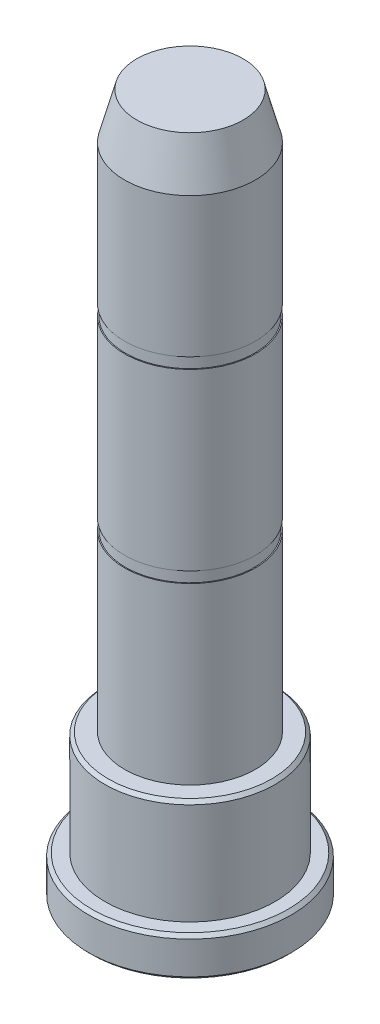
ISO-10303-21;
HEADER;
FILE_DESCRIPTION(('STEP AP214'),'2;1');
FILE_NAME('part.step','',(''),(''),'','','');
FILE_SCHEMA(('AUTOMOTIVE_DESIGN { 1 0 10303 214 1 1 1 1 }'));
ENDSEC;
DATA;
#1=APPLICATION_CONTEXT('core data for automotive mechanical design processes');
#2=APPLICATION_PROTOCOL_DEFINITION('international standard','automotive_design',2000,#1);
#3=PRODUCT_CONTEXT('',#1,'mechanical');
#4=PRODUCT('Part','Part','',(#3));
#5=PRODUCT_RELATED_PRODUCT_CATEGORY('part','',(#4));
#6=PRODUCT_DEFINITION_FORMATION('','',#4);
#7=PRODUCT_DEFINITION_CONTEXT('part definition',#1,'design');
#8=PRODUCT_DEFINITION('design','',#6,#7);
#9=PRODUCT_DEFINITION_SHAPE('','',#8);
#10=(LENGTH_UNIT() NAMED_UNIT(*) SI_UNIT(.MILLI.,.METRE.));
#11=(NAMED_UNIT(*) PLANE_ANGLE_UNIT() SI_UNIT($,.RADIAN.));
#12=(NAMED_UNIT(*) SI_UNIT($,.STERADIAN.) SOLID_ANGLE_UNIT());
#13=UNCERTAINTY_MEASURE_WITH_UNIT(LENGTH_MEASURE(1.E-05),#10,'distance_accuracy_value','');
#14=(GEOMETRIC_REPRESENTATION_CONTEXT(3) GLOBAL_UNCERTAINTY_ASSIGNED_CONTEXT((#13)) GLOBAL_UNIT_ASSIGNED_CONTEXT((#10,
#11,#12)) REPRESENTATION_CONTEXT('',''));
#15=CARTESIAN_POINT('',(0.,0.,0.));
#16=DIRECTION('',(0.,0.,1.));
#17=DIRECTION('',(1.,0.,0.));
#18=AXIS2_PLACEMENT_3D('',#15,#16,#17);
#19=CARTESIAN_POINT('',(-8.12435565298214,101.,0.));
#20=DIRECTION('',(0.,-1.,0.));
#21=DIRECTION('',(1.,0.,0.));
#22=AXIS2_PLACEMENT_3D('',#19,#20,#21);
#23=PLANE('',#22);
#24=CARTESIAN_POINT('',(0.,101.,0.));
#25=DIRECTION('',(0.,1.,0.));
#26=DIRECTION('',(-1.,0.,0.));
#27=AXIS2_PLACEMENT_3D('',#24,#25,#26);
#28=CIRCLE('',#27,8.12435565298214);
#29=CARTESIAN_POINT('',(-8.12435565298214,101.,0.));
#30=VERTEX_POINT('',#29);
#31=EDGE_CURVE('E49',#30,#30,#28,.T.);
#32=ORIENTED_EDGE('',*,*,#31,.T.);
#33=EDGE_LOOP('',(#32));
#34=FACE_BOUND('',#33,.T.);
#35=ADVANCED_FACE('F13',(#34),#23,.F.);
#36=CARTESIAN_POINT('',(0.,101.,0.));
#37=DIRECTION('',(0.,-1.,0.));
#38=DIRECTION('',(1.,0.,0.));
#39=AXIS2_PLACEMENT_3D('',#36,#37,#38);
#40=CONICAL_SURFACE('',#39,8.12435565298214,0.261799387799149);
#41=CARTESIAN_POINT('',(0.,94.,0.));
#42=DIRECTION('',(0.,1.,0.));
#43=DIRECTION('',(-1.,0.,0.));
#44=AXIS2_PLACEMENT_3D('',#41,#42,#43);
#45=CIRCLE('',#44,10.);
#46=CARTESIAN_POINT('',(-10.,94.,0.));
#47=VERTEX_POINT('',#46);
#48=EDGE_CURVE('E52',#47,#47,#45,.T.);
#49=ORIENTED_EDGE('',*,*,#48,.T.);
#50=EDGE_LOOP('',(#49));
#51=FACE_BOUND('',#50,.T.);
#52=ORIENTED_EDGE('',*,*,#31,.F.);
#53=EDGE_LOOP('',(#52));
#54=FACE_BOUND('',#53,.T.);
#55=ADVANCED_FACE('F112',(#51,#54),#40,.T.);
#56=CARTESIAN_POINT('',(0.,101.,0.));
#57=DIRECTION('',(0.,1.,0.));
#58=DIRECTION('',(-1.,0.,0.));
#59=AXIS2_PLACEMENT_3D('',#56,#57,#58);
#60=CYLINDRICAL_SURFACE('',#59,10.);
#61=ORIENTED_EDGE('',*,*,#48,.F.);
#62=EDGE_LOOP('',(#61));
#63=FACE_BOUND('',#62,.T.);
#64=CARTESIAN_POINT('',(0.,72.6666666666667,0.));
#65=DIRECTION('',(0.,1.,0.));
#66=DIRECTION('',(-1.,0.,0.));
#67=AXIS2_PLACEMENT_3D('',#64,#65,#66);
#68=CIRCLE('',#67,10.);
#69=CARTESIAN_POINT('',(-10.,72.6666666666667,0.));
#70=VERTEX_POINT('',#69);
#71=EDGE_CURVE('E56',#70,#70,#68,.T.);
#72=ORIENTED_EDGE('',*,*,#71,.T.);
#73=EDGE_LOOP('',(#72));
#74=FACE_BOUND('',#73,.T.);
#75=ADVANCED_FACE('F117',(#63,#74),#60,.T.);
#76=CARTESIAN_POINT('',(-9.85,72.6666666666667,0.));
#77=DIRECTION('',(0.,1.,0.));
#78=DIRECTION('',(-1.,0.,0.));
#79=AXIS2_PLACEMENT_3D('',#76,#77,#78);
#80=PLANE('',#79);
#81=ORIENTED_EDGE('',*,*,#71,.F.);
#82=EDGE_LOOP('',(#81));
#83=FACE_BOUND('',#82,.T.);
#84=CARTESIAN_POINT('',(0.,72.6666666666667,0.));
#85=DIRECTION('',(0.,1.,0.));
#86=DIRECTION('',(-1.,0.,0.));
#87=AXIS2_PLACEMENT_3D('',#84,#85,#86);
#88=CIRCLE('',#87,9.85);
#89=CARTESIAN_POINT('',(-9.85,72.6666666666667,0.));
#90=VERTEX_POINT('',#89);
#91=EDGE_CURVE('E60',#90,#90,#88,.T.);
#92=ORIENTED_EDGE('',*,*,#91,.T.);
#93=EDGE_LOOP('',(#92));
#94=FACE_BOUND('',#93,.T.);
#95=ADVANCED_FACE('F262',(#83,#94),#80,.F.);
#96=CARTESIAN_POINT('',(0.,101.,0.));
#97=DIRECTION('',(0.,1.,0.));
#98=DIRECTION('',(-1.,0.,0.));
#99=AXIS2_PLACEMENT_3D('',#96,#97,#98);
#100=CYLINDRICAL_SURFACE('',#99,9.85);
#101=ORIENTED_EDGE('',*,*,#91,.F.);
#102=EDGE_LOOP('',(#101));
#103=FACE_BOUND('',#102,.T.);
#104=CARTESIAN_POINT('',(0.,71.,0.));
#105=DIRECTION('',(0.,1.,0.));
#106=DIRECTION('',(-1.,0.,0.));
#107=AXIS2_PLACEMENT_3D('',#104,#105,#106);
#108=CIRCLE('',#107,9.85);
#109=CARTESIAN_POINT('',(-9.85,71.,0.));
#110=VERTEX_POINT('',#109);
#111=EDGE_CURVE('E64',#110,#110,#108,.T.);
#112=ORIENTED_EDGE('',*,*,#111,.T.);
#113=EDGE_LOOP('',(#112));
#114=FACE_BOUND('',#113,.T.);
#115=ADVANCED_FACE('F252',(#103,#114),#100,.T.);
#116=CARTESIAN_POINT('',(-10.,71.,0.));
#117=DIRECTION('',(0.,-1.,0.));
#118=DIRECTION('',(1.,0.,0.));
#119=AXIS2_PLACEMENT_3D('',#116,#117,#118);
#120=PLANE('',#119);
#121=ORIENTED_EDGE('',*,*,#111,.F.);
#122=EDGE_LOOP('',(#121));
#123=FACE_BOUND('',#122,.T.);
#124=CARTESIAN_POINT('',(0.,71.,0.));
#125=DIRECTION('',(0.,1.,0.));
#126=DIRECTION('',(-1.,0.,0.));
#127=AXIS2_PLACEMENT_3D('',#124,#125,#126);
#128=CIRCLE('',#127,10.);
#129=CARTESIAN_POINT('',(-10.,71.,0.));
#130=VERTEX_POINT('',#129);
#131=EDGE_CURVE('E68',#130,#130,#128,.T.);
#132=ORIENTED_EDGE('',*,*,#131,.T.);
#133=EDGE_LOOP('',(#132));
#134=FACE_BOUND('',#133,.T.);
#135=ADVANCED_FACE('F242',(#123,#134),#120,.F.);
#136=CARTESIAN_POINT('',(0.,101.,0.));
#137=DIRECTION('',(0.,1.,0.));
#138=DIRECTION('',(-1.,0.,0.));
#139=AXIS2_PLACEMENT_3D('',#136,#137,#138);
#140=CYLINDRICAL_SURFACE('',#139,10.);
#141=ORIENTED_EDGE('',*,*,#131,.F.);
#142=EDGE_LOOP('',(#141));
#143=FACE_BOUND('',#142,.T.);
#144=CARTESIAN_POINT('',(0.,44.3333333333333,0.));
#145=DIRECTION('',(0.,1.,0.));
#146=DIRECTION('',(-1.,0.,0.));
#147=AXIS2_PLACEMENT_3D('',#144,#145,#146);
#148=CIRCLE('',#147,10.);
#149=CARTESIAN_POINT('',(-10.,44.3333333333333,0.));
#150=VERTEX_POINT('',#149);
#151=EDGE_CURVE('E72',#150,#150,#148,.T.);
#152=ORIENTED_EDGE('',*,*,#151,.T.);
#153=EDGE_LOOP('',(#152));
#154=FACE_BOUND('',#153,.T.);
#155=ADVANCED_FACE('F232',(#143,#154),#140,.T.);
#156=CARTESIAN_POINT('',(-9.85,44.3333333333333,0.));
#157=DIRECTION('',(0.,1.,0.));
#158=DIRECTION('',(-1.,0.,0.));
#159=AXIS2_PLACEMENT_3D('',#156,#157,#158);
#160=PLANE('',#159);
#161=ORIENTED_EDGE('',*,*,#151,.F.);
#162=EDGE_LOOP('',(#161));
#163=FACE_BOUND('',#162,.T.);
#164=CARTESIAN_POINT('',(0.,44.3333333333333,0.));
#165=DIRECTION('',(0.,1.,0.));
#166=DIRECTION('',(-1.,0.,0.));
#167=AXIS2_PLACEMENT_3D('',#164,#165,#166);
#168=CIRCLE('',#167,9.85);
#169=CARTESIAN_POINT('',(-9.85,44.3333333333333,0.));
#170=VERTEX_POINT('',#169);
#171=EDGE_CURVE('E75',#170,#170,#168,.T.);
#172=ORIENTED_EDGE('',*,*,#171,.T.);
#173=EDGE_LOOP('',(#172));
#174=FACE_BOUND('',#173,.T.);
#175=ADVANCED_FACE('F222',(#163,#174),#160,.F.);
#176=CARTESIAN_POINT('',(0.,101.,0.));
#177=DIRECTION('',(0.,1.,0.));
#178=DIRECTION('',(-1.,0.,0.));
#179=AXIS2_PLACEMENT_3D('',#176,#177,#178);
#180=CYLINDRICAL_SURFACE('',#179,9.85);
#181=ORIENTED_EDGE('',*,*,#171,.F.);
#182=EDGE_LOOP('',(#181));
#183=FACE_BOUND('',#182,.T.);
#184=CARTESIAN_POINT('',(0.,42.6666666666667,0.));
#185=DIRECTION('',(0.,1.,0.));
#186=DIRECTION('',(-1.,0.,0.));
#187=AXIS2_PLACEMENT_3D('',#184,#185,#186);
#188=CIRCLE('',#187,9.85);
#189=CARTESIAN_POINT('',(-9.85,42.6666666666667,0.));
#190=VERTEX_POINT('',#189);
#191=EDGE_CURVE('E79',#190,#190,#188,.T.);
#192=ORIENTED_EDGE('',*,*,#191,.T.);
#193=EDGE_LOOP('',(#192));
#194=FACE_BOUND('',#193,.T.);
#195=ADVANCED_FACE('F212',(#183,#194),#180,.T.);
#196=CARTESIAN_POINT('',(-10.,42.6666666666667,0.));
#197=DIRECTION('',(0.,-1.,0.));
#198=DIRECTION('',(1.,0.,0.));
#199=AXIS2_PLACEMENT_3D('',#196,#197,#198);
#200=PLANE('',#199);
#201=ORIENTED_EDGE('',*,*,#191,.F.);
#202=EDGE_LOOP('',(#201));
#203=FACE_BOUND('',#202,.T.);
#204=CARTESIAN_POINT('',(0.,42.6666666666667,0.));
#205=DIRECTION('',(0.,1.,0.));
#206=DIRECTION('',(-1.,0.,0.));
#207=AXIS2_PLACEMENT_3D('',#204,#205,#206);
#208=CIRCLE('',#207,10.);
#209=CARTESIAN_POINT('',(-10.,42.6666666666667,0.));
#210=VERTEX_POINT('',#209);
#211=EDGE_CURVE('E83',#210,#210,#208,.T.);
#212=ORIENTED_EDGE('',*,*,#211,.T.);
#213=EDGE_LOOP('',(#212));
#214=FACE_BOUND('',#213,.T.);
#215=ADVANCED_FACE('F202',(#203,#214),#200,.F.);
#216=CARTESIAN_POINT('',(0.,101.,0.));
#217=DIRECTION('',(0.,1.,0.));
#218=DIRECTION('',(-1.,0.,0.));
#219=AXIS2_PLACEMENT_3D('',#216,#217,#218);
#220=CYLINDRICAL_SURFACE('',#219,10.);
#221=ORIENTED_EDGE('',*,*,#211,.F.);
#222=EDGE_LOOP('',(#221));
#223=FACE_BOUND('',#222,.T.);
#224=CARTESIAN_POINT('',(0.,16.,0.));
#225=DIRECTION('',(0.,1.,0.));
#226=DIRECTION('',(-1.,0.,0.));
#227=AXIS2_PLACEMENT_3D('',#224,#225,#226);
#228=CIRCLE('',#227,10.);
#229=CARTESIAN_POINT('',(-10.,16.,0.));
#230=VERTEX_POINT('',#229);
#231=EDGE_CURVE('E86',#230,#230,#228,.T.);
#232=ORIENTED_EDGE('',*,*,#231,.T.);
#233=EDGE_LOOP('',(#232));
#234=FACE_BOUND('',#233,.T.);
#235=ADVANCED_FACE('F192',(#223,#234),#220,.T.);
#236=CARTESIAN_POINT('',(-13.,16.,0.));
#237=DIRECTION('',(0.,-1.,0.));
#238=DIRECTION('',(1.,0.,0.));
#239=AXIS2_PLACEMENT_3D('',#236,#237,#238);
#240=PLANE('',#239);
#241=CARTESIAN_POINT('',(0.,16.,0.));
#242=DIRECTION('',(0.,-1.,0.));
#243=DIRECTION('',(1.,0.,0.));
#244=AXIS2_PLACEMENT_3D('',#241,#242,#243);
#245=CIRCLE('',#244,12.5);
#246=CARTESIAN_POINT('',(12.5,16.,0.));
#247=VERTEX_POINT('',#246);
#248=EDGE_CURVE('E46',#247,#247,#245,.F.);
#249=ORIENTED_EDGE('',*,*,#248,.T.);
#250=EDGE_LOOP('',(#249));
#251=FACE_BOUND('',#250,.T.);
#252=ORIENTED_EDGE('',*,*,#231,.F.);
#253=EDGE_LOOP('',(#252));
#254=FACE_BOUND('',#253,.T.);
#255=ADVANCED_FACE('F108',(#251,#254),#240,.F.);
#256=CARTESIAN_POINT('',(0.,101.,0.));
#257=DIRECTION('',(0.,1.,0.));
#258=DIRECTION('',(-1.,0.,0.));
#259=AXIS2_PLACEMENT_3D('',#256,#257,#258);
#260=CYLINDRICAL_SURFACE('',#259,13.);
#261=CARTESIAN_POINT('',(0.,15.5,0.));
#262=DIRECTION('',(0.,-1.,0.));
#263=DIRECTION('',(1.,0.,0.));
#264=AXIS2_PLACEMENT_3D('',#261,#262,#263);
#265=CIRCLE('',#264,13.);
#266=CARTESIAN_POINT('',(13.,15.5,0.));
#267=VERTEX_POINT('',#266);
#268=EDGE_CURVE('E42',#267,#267,#265,.T.);
#269=ORIENTED_EDGE('',*,*,#268,.T.);
#270=EDGE_LOOP('',(#269));
#271=FACE_BOUND('',#270,.T.);
#272=CARTESIAN_POINT('',(0.,0.,0.));
#273=DIRECTION('',(0.,1.,0.));
#274=DIRECTION('',(-1.,0.,0.));
#275=AXIS2_PLACEMENT_3D('',#272,#273,#274);
#276=CIRCLE('',#275,13.);
#277=CARTESIAN_POINT('',(-13.,0.,0.));
#278=VERTEX_POINT('',#277);
#279=EDGE_CURVE('E90',#278,#278,#276,.T.);
#280=ORIENTED_EDGE('',*,*,#279,.T.);
#281=EDGE_LOOP('',(#280));
#282=FACE_BOUND('',#281,.T.);
#283=ADVANCED_FACE('F95',(#271,#282),#260,.T.);
#284=CARTESIAN_POINT('',(-15.5,0.,0.));
#285=DIRECTION('',(0.,-1.,0.));
#286=DIRECTION('',(1.,0.,0.));
#287=AXIS2_PLACEMENT_3D('',#284,#285,#286);
#288=PLANE('',#287);
#289=CARTESIAN_POINT('',(0.,0.,0.));
#290=DIRECTION('',(0.,-1.,0.));
#291=DIRECTION('',(1.,0.,0.));
#292=AXIS2_PLACEMENT_3D('',#289,#290,#291);
#293=CIRCLE('',#292,15.);
#294=CARTESIAN_POINT('',(15.,0.,0.));
#295=VERTEX_POINT('',#294);
#296=EDGE_CURVE('E36',#295,#295,#293,.F.);
#297=ORIENTED_EDGE('',*,*,#296,.T.);
#298=EDGE_LOOP('',(#297));
#299=FACE_BOUND('',#298,.T.);
#300=ORIENTED_EDGE('',*,*,#279,.F.);
#301=EDGE_LOOP('',(#300));
#302=FACE_BOUND('',#301,.T.);
#303=ADVANCED_FACE('F97',(#299,#302),#288,.F.);
#304=CARTESIAN_POINT('',(0.,101.,0.));
#305=DIRECTION('',(0.,1.,0.));
#306=DIRECTION('',(-1.,0.,0.));
#307=AXIS2_PLACEMENT_3D('',#304,#305,#306);
#308=CYLINDRICAL_SURFACE('',#307,15.5);
#309=CARTESIAN_POINT('',(0.,-0.5,0.));
#310=DIRECTION('',(0.,-1.,0.));
#311=DIRECTION('',(1.,0.,0.));
#312=AXIS2_PLACEMENT_3D('',#309,#310,#311);
#313=CIRCLE('',#312,15.5);
#314=CARTESIAN_POINT('',(15.5,-0.499999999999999,0.));
#315=VERTEX_POINT('',#314);
#316=EDGE_CURVE('E21',#315,#315,#313,.T.);
#317=ORIENTED_EDGE('',*,*,#316,.T.);
#318=EDGE_LOOP('',(#317));
#319=FACE_BOUND('',#318,.T.);
#320=CARTESIAN_POINT('',(0.,-5.5,0.));
#321=DIRECTION('',(0.,1.,0.));
#322=DIRECTION('',(-1.,0.,0.));
#323=AXIS2_PLACEMENT_3D('',#320,#321,#322);
#324=CIRCLE('',#323,15.5);
#325=CARTESIAN_POINT('',(-15.5,-5.5,0.));
#326=VERTEX_POINT('',#325);
#327=EDGE_CURVE('E29',#326,#326,#324,.T.);
#328=ORIENTED_EDGE('',*,*,#327,.T.);
#329=EDGE_LOOP('',(#328));
#330=FACE_BOUND('',#329,.T.);
#331=ADVANCED_FACE('F99',(#319,#330),#308,.T.);
#332=CARTESIAN_POINT('',(0.,-6.,0.));
#333=DIRECTION('',(0.,1.,0.));
#334=DIRECTION('',(-1.,0.,0.));
#335=AXIS2_PLACEMENT_3D('',#332,#333,#334);
#336=PLANE('',#335);
#337=CARTESIAN_POINT('',(0.,-6.,0.));
#338=DIRECTION('',(0.,1.,0.));
#339=DIRECTION('',(-1.,0.,0.));
#340=AXIS2_PLACEMENT_3D('',#337,#338,#339);
#341=CIRCLE('',#340,15.);
#342=CARTESIAN_POINT('',(-15.,-6.,0.));
#343=VERTEX_POINT('',#342);
#344=EDGE_CURVE('E8',#343,#343,#341,.F.);
#345=ORIENTED_EDGE('',*,*,#344,.T.);
#346=EDGE_LOOP('',(#345));
#347=FACE_BOUND('',#346,.T.);
#348=ADVANCED_FACE('F106',(#347),#336,.F.);
#349=CARTESIAN_POINT('',(0.,16.,0.));
#350=DIRECTION('',(0.,-1.,0.));
#351=DIRECTION('',(1.,0.,0.));
#352=AXIS2_PLACEMENT_3D('',#349,#350,#351);
#353=CONICAL_SURFACE('',#352,12.5,0.785398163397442);
#354=ORIENTED_EDGE('',*,*,#268,.F.);
#355=EDGE_LOOP('',(#354));
#356=FACE_BOUND('',#355,.T.);
#357=ORIENTED_EDGE('',*,*,#248,.F.);
#358=EDGE_LOOP('',(#357));
#359=FACE_BOUND('',#358,.T.);
#360=ADVANCED_FACE('F122',(#356,#359),#353,.T.);
#361=CARTESIAN_POINT('',(0.,0.,0.));
#362=DIRECTION('',(0.,-1.,0.));
#363=DIRECTION('',(1.,0.,0.));
#364=AXIS2_PLACEMENT_3D('',#361,#362,#363);
#365=CONICAL_SURFACE('',#364,15.,0.785398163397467);
#366=ORIENTED_EDGE('',*,*,#316,.F.);
#367=EDGE_LOOP('',(#366));
#368=FACE_BOUND('',#367,.T.);
#369=ORIENTED_EDGE('',*,*,#296,.F.);
#370=EDGE_LOOP('',(#369));
#371=FACE_BOUND('',#370,.T.);
#372=ADVANCED_FACE('F124',(#368,#371),#365,.T.);
#373=CARTESIAN_POINT('',(0.,-5.5,0.));
#374=DIRECTION('',(0.,1.,0.));
#375=DIRECTION('',(-1.,0.,0.));
#376=AXIS2_PLACEMENT_3D('',#373,#374,#375);
#377=CONICAL_SURFACE('',#376,15.5,0.785398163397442);
#378=ORIENTED_EDGE('',*,*,#344,.F.);
#379=EDGE_LOOP('',(#378));
#380=FACE_BOUND('',#379,.T.);
#381=ORIENTED_EDGE('',*,*,#327,.F.);
#382=EDGE_LOOP('',(#381));
#383=FACE_BOUND('',#382,.T.);
#384=ADVANCED_FACE('F15',(#380,#383),#377,.T.);
#385=CLOSED_SHELL('',(#35,#55,#75,#95,#115,#135,#155,#175,#195,#215,#235,#255,#283,#303,#331,
#348,#360,#372,#384));
#386=MANIFOLD_SOLID_BREP('B1',#385);
#387=ADVANCED_BREP_SHAPE_REPRESENTATION('',(#18,#386),#14);
#388=SHAPE_DEFINITION_REPRESENTATION(#9,#387);
ENDSEC;
END-ISO-10303-21;
